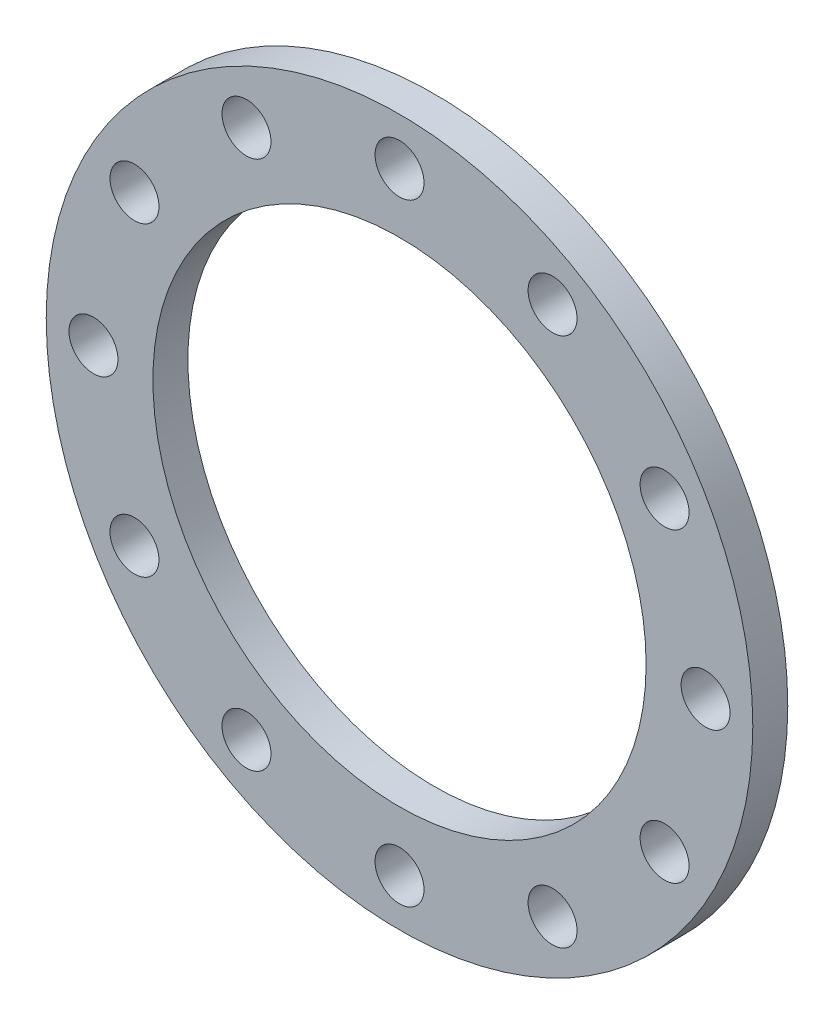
from build123d import *

# Parameters (mm, degrees)
SKETCH_1_R               = 10.1
SKETCH_1_R_2             = 7.05
EXTRUDE_1_DEPTH          = 1
HOLE_WIZARD_1_4_1_4_1_D  = 1.4
PATTERN_CIRCULAR_1_COUNT = 12


with BuildPart() as part:
    # Sketch 1 → Extrude 1 (new body)
    with BuildSketch(Plane.XY):
        Circle(SKETCH_1_R)
        Circle(SKETCH_1_R_2, mode=Mode.SUBTRACT)
    extrude(amount=EXTRUDE_1_DEPTH)

    # Hole Wizard 1.4 _1.4_ _1 (through all)
    with Locations(Plane.XY.offset(1)):
        with Locations((0, 8.75)):
            hole_wizard_1_4_1_4_1 = Hole(HOLE_WIZARD_1_4_1_4_1_D / 2)

    # Pattern Circular 1: Hole Wizard 1.4 _1.4_ _1 ×12 about axis
    pattern_circular_1_axis = Axis((0, 0, 0), (0, 0, 1))
    for i in range(1, PATTERN_CIRCULAR_1_COUNT):
        add(hole_wizard_1_4_1_4_1.rotate(pattern_circular_1_axis, i * 360 / PATTERN_CIRCULAR_1_COUNT), mode=Mode.SUBTRACT)


solid = part.part
